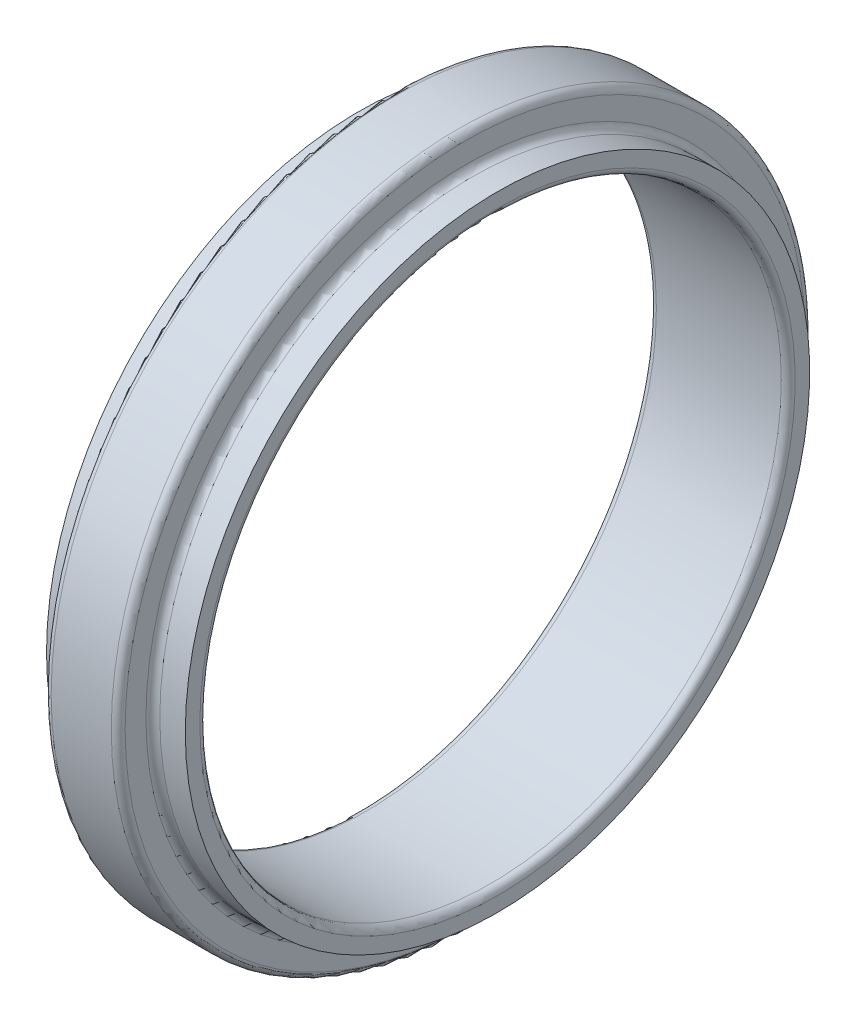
from build123d import *


with BuildPart() as part:
    # Sketch1 → Base-Revolve (revolve)
    with BuildSketch(Plane.XY, mode=Mode.PRIVATE) as base_revolve_sk:
        with BuildLine():
            Line((-1.651, 19.05), (1.651, 19.05))
            ThreePointArc((1.651, 19.05), (1.920407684, 18.938407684), (2.032, 18.669))
            Line((2.032, 18.669), (2.032, 17.526))
            ThreePointArc((2.032, 17.526), (2.143592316, 17.256592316), (2.413, 17.145))
            Line((2.413, 17.145), (3.81, 17.145))
            Line((3.81, 17.145), (3.81, 16.3449))
            ThreePointArc((3.81, 16.3449), (3.698407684, 16.075492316), (3.429, 15.9639))
            Line((3.429, 15.9639), (-3.429, 15.9639))
            ThreePointArc((-3.429, 15.9639), (-3.698407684, 16.075492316), (-3.81, 16.3449))
            Line((-3.81, 16.3449), (-3.81, 17.145))
            Line((-3.81, 17.145), (-2.413, 17.145))
            ThreePointArc((-2.413, 17.145), (-2.143592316, 17.256592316), (-2.032, 17.526))
            Line((-2.032, 17.526), (-2.032, 18.669))
            ThreePointArc((-2.032, 18.669), (-1.920407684, 18.938407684), (-1.651, 19.05))
        make_face()
    revolve(base_revolve_sk.sketch.rotate(Axis((0, 0, 0), (1, 0, 0)), 90), axis=Axis((0, 0, 0), (1, 0, 0)))


solid = part.part
